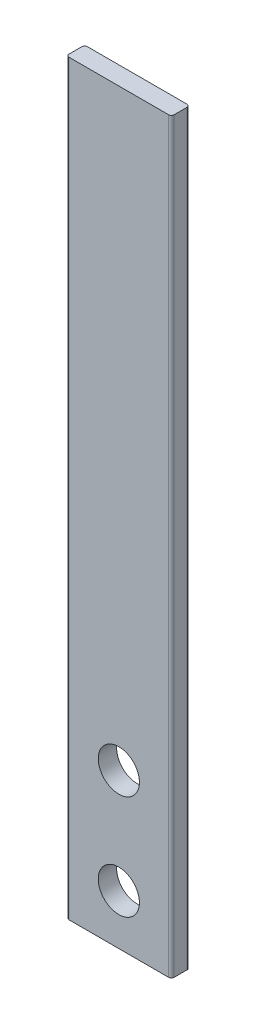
ISO-10303-21;
HEADER;
FILE_DESCRIPTION(('STEP AP214'),'2;1');
FILE_NAME('part.step','',(''),(''),'','','');
FILE_SCHEMA(('AUTOMOTIVE_DESIGN { 1 0 10303 214 1 1 1 1 }'));
ENDSEC;
DATA;
#1=APPLICATION_CONTEXT('core data for automotive mechanical design processes');
#2=APPLICATION_PROTOCOL_DEFINITION('international standard','automotive_design',2000,#1);
#3=PRODUCT_CONTEXT('',#1,'mechanical');
#4=PRODUCT('Part','Part','',(#3));
#5=PRODUCT_RELATED_PRODUCT_CATEGORY('part','',(#4));
#6=PRODUCT_DEFINITION_FORMATION('','',#4);
#7=PRODUCT_DEFINITION_CONTEXT('part definition',#1,'design');
#8=PRODUCT_DEFINITION('design','',#6,#7);
#9=PRODUCT_DEFINITION_SHAPE('','',#8);
#10=(LENGTH_UNIT() NAMED_UNIT(*) SI_UNIT(.MILLI.,.METRE.));
#11=(NAMED_UNIT(*) PLANE_ANGLE_UNIT() SI_UNIT($,.RADIAN.));
#12=(NAMED_UNIT(*) SI_UNIT($,.STERADIAN.) SOLID_ANGLE_UNIT());
#13=UNCERTAINTY_MEASURE_WITH_UNIT(LENGTH_MEASURE(1.E-05),#10,'distance_accuracy_value','');
#14=(GEOMETRIC_REPRESENTATION_CONTEXT(3) GLOBAL_UNCERTAINTY_ASSIGNED_CONTEXT((#13)) GLOBAL_UNIT_ASSIGNED_CONTEXT((#10,
#11,#12)) REPRESENTATION_CONTEXT('',''));
#15=CARTESIAN_POINT('',(0.,0.,0.));
#16=DIRECTION('',(0.,0.,1.));
#17=DIRECTION('',(1.,0.,0.));
#18=AXIS2_PLACEMENT_3D('',#15,#16,#17);
#19=CARTESIAN_POINT('',(4.8006,-34.1249,-1.6764));
#20=DIRECTION('',(1.,0.,0.));
#21=DIRECTION('',(0.,0.,-1.));
#22=AXIS2_PLACEMENT_3D('',#19,#20,#21);
#23=PLANE('',#22);
#24=DIRECTION('',(0.,0.,1.));
#25=VECTOR('',#24,1.);
#26=CARTESIAN_POINT('',(4.8006,-34.1249,-1.6764));
#27=LINE('',#26,#25);
#28=CARTESIAN_POINT('',(4.8006,-34.1249,-1.4224));
#29=VERTEX_POINT('',#28);
#30=CARTESIAN_POINT('',(4.8006,-34.1249,-0.254));
#31=VERTEX_POINT('',#30);
#32=EDGE_CURVE('E131',#29,#31,#27,.T.);
#33=ORIENTED_EDGE('',*,*,#32,.F.);
#34=DIRECTION('',(0.,1.,0.));
#35=VECTOR('',#34,1.);
#36=CARTESIAN_POINT('',(4.8006,-34.1249,-1.4224));
#37=LINE('',#36,#35);
#38=CARTESIAN_POINT('',(4.8006,34.1249,-1.4224));
#39=VERTEX_POINT('',#38);
#40=EDGE_CURVE('E148',#29,#39,#37,.T.);
#41=ORIENTED_EDGE('',*,*,#40,.T.);
#42=DIRECTION('',(0.,0.,1.));
#43=VECTOR('',#42,1.);
#44=CARTESIAN_POINT('',(4.8006,34.1249,-1.6764));
#45=LINE('',#44,#43);
#46=CARTESIAN_POINT('',(4.8006,34.1249,-0.254));
#47=VERTEX_POINT('',#46);
#48=EDGE_CURVE('E123',#39,#47,#45,.T.);
#49=ORIENTED_EDGE('',*,*,#48,.T.);
#50=DIRECTION('',(0.,1.,0.));
#51=VECTOR('',#50,1.);
#52=CARTESIAN_POINT('',(4.8006,-34.1249,-0.254));
#53=LINE('',#52,#51);
#54=EDGE_CURVE('E112',#47,#31,#53,.F.);
#55=ORIENTED_EDGE('',*,*,#54,.T.);
#56=EDGE_LOOP('',(#33,#41,#49,#55));
#57=FACE_BOUND('',#56,.T.);
#58=ADVANCED_FACE('F35',(#57),#23,.T.);
#59=CARTESIAN_POINT('',(-4.8006,-34.1249,-1.6764));
#60=DIRECTION('',(0.,-1.,0.));
#61=DIRECTION('',(0.,0.,-1.));
#62=AXIS2_PLACEMENT_3D('',#59,#60,#61);
#63=PLANE('',#62);
#64=DIRECTION('',(0.,0.,1.));
#65=VECTOR('',#64,1.);
#66=CARTESIAN_POINT('',(-4.8006,-34.1249,-1.6764));
#67=LINE('',#66,#65);
#68=CARTESIAN_POINT('',(-4.8006,-34.1249,-1.4224));
#69=VERTEX_POINT('',#68);
#70=CARTESIAN_POINT('',(-4.8006,-34.1249,-0.254));
#71=VERTEX_POINT('',#70);
#72=EDGE_CURVE('E122',#69,#71,#67,.T.);
#73=ORIENTED_EDGE('',*,*,#72,.F.);
#74=CARTESIAN_POINT('',(-4.5466,-34.1249,-1.4224));
#75=DIRECTION('',(0.,-1.,0.));
#76=DIRECTION('',(0.,0.,-1.));
#77=AXIS2_PLACEMENT_3D('',#74,#75,#76);
#78=CIRCLE('',#77,0.254);
#79=CARTESIAN_POINT('',(-4.5466,-34.1249,-1.6764));
#80=VERTEX_POINT('',#79);
#81=EDGE_CURVE('E126',#69,#80,#78,.T.);
#82=ORIENTED_EDGE('',*,*,#81,.T.);
#83=DIRECTION('',(1.,0.,0.));
#84=VECTOR('',#83,1.);
#85=CARTESIAN_POINT('',(-4.8006,-34.1249,-1.6764));
#86=LINE('',#85,#84);
#87=CARTESIAN_POINT('',(4.5466,-34.1249,-1.6764));
#88=VERTEX_POINT('',#87);
#89=EDGE_CURVE('E165',#80,#88,#86,.T.);
#90=ORIENTED_EDGE('',*,*,#89,.T.);
#91=CARTESIAN_POINT('',(4.5466,-34.1249,-1.4224));
#92=DIRECTION('',(0.,-1.,0.));
#93=DIRECTION('',(0.,0.,-1.));
#94=AXIS2_PLACEMENT_3D('',#91,#92,#93);
#95=CIRCLE('',#94,0.254);
#96=EDGE_CURVE('E136',#88,#29,#95,.T.);
#97=ORIENTED_EDGE('',*,*,#96,.T.);
#98=ORIENTED_EDGE('',*,*,#32,.T.);
#99=CARTESIAN_POINT('',(4.5466,-34.1249,-0.254));
#100=DIRECTION('',(0.,-1.,0.));
#101=DIRECTION('',(0.,0.,-1.));
#102=AXIS2_PLACEMENT_3D('',#99,#100,#101);
#103=CIRCLE('',#102,0.254);
#104=CARTESIAN_POINT('',(4.5466,-34.1249,0.));
#105=VERTEX_POINT('',#104);
#106=EDGE_CURVE('E129',#31,#105,#103,.T.);
#107=ORIENTED_EDGE('',*,*,#106,.T.);
#108=DIRECTION('',(1.,0.,0.));
#109=VECTOR('',#108,1.);
#110=CARTESIAN_POINT('',(-4.8006,-34.1249,0.));
#111=LINE('',#110,#109);
#112=CARTESIAN_POINT('',(-4.5466,-34.1249,0.));
#113=VERTEX_POINT('',#112);
#114=EDGE_CURVE('E156',#113,#105,#111,.T.);
#115=ORIENTED_EDGE('',*,*,#114,.F.);
#116=CARTESIAN_POINT('',(-4.5466,-34.1249,-0.254));
#117=DIRECTION('',(0.,-1.,0.));
#118=DIRECTION('',(0.,0.,-1.));
#119=AXIS2_PLACEMENT_3D('',#116,#117,#118);
#120=CIRCLE('',#119,0.254);
#121=EDGE_CURVE('E127',#113,#71,#120,.T.);
#122=ORIENTED_EDGE('',*,*,#121,.T.);
#123=EDGE_LOOP('',(#73,#82,#90,#97,#98,#107,#115,#122));
#124=FACE_BOUND('',#123,.T.);
#125=ADVANCED_FACE('F161',(#124),#63,.T.);
#126=CARTESIAN_POINT('',(-4.8006,-34.1249,-1.6764));
#127=DIRECTION('',(-1.,0.,0.));
#128=DIRECTION('',(0.,0.,1.));
#129=AXIS2_PLACEMENT_3D('',#126,#127,#128);
#130=PLANE('',#129);
#131=DIRECTION('',(0.,0.,1.));
#132=VECTOR('',#131,1.);
#133=CARTESIAN_POINT('',(-4.8006,34.1249,-1.6764));
#134=LINE('',#133,#132);
#135=CARTESIAN_POINT('',(-4.8006,34.1249,-1.4224));
#136=VERTEX_POINT('',#135);
#137=CARTESIAN_POINT('',(-4.8006,34.1249,-0.254));
#138=VERTEX_POINT('',#137);
#139=EDGE_CURVE('E105',#136,#138,#134,.T.);
#140=ORIENTED_EDGE('',*,*,#139,.F.);
#141=DIRECTION('',(0.,-1.,0.));
#142=VECTOR('',#141,1.);
#143=CARTESIAN_POINT('',(-4.8006,-34.1249,-1.4224));
#144=LINE('',#143,#142);
#145=EDGE_CURVE('E118',#136,#69,#144,.T.);
#146=ORIENTED_EDGE('',*,*,#145,.T.);
#147=ORIENTED_EDGE('',*,*,#72,.T.);
#148=DIRECTION('',(0.,-1.,0.));
#149=VECTOR('',#148,1.);
#150=CARTESIAN_POINT('',(-4.8006,34.1249,-0.254));
#151=LINE('',#150,#149);
#152=EDGE_CURVE('E121',#71,#138,#151,.F.);
#153=ORIENTED_EDGE('',*,*,#152,.T.);
#154=EDGE_LOOP('',(#140,#146,#147,#153));
#155=FACE_BOUND('',#154,.T.);
#156=ADVANCED_FACE('F116',(#155),#130,.T.);
#157=CARTESIAN_POINT('',(-4.8006,34.1249,-1.6764));
#158=DIRECTION('',(0.,1.,0.));
#159=DIRECTION('',(0.,0.,1.));
#160=AXIS2_PLACEMENT_3D('',#157,#158,#159);
#161=PLANE('',#160);
#162=DIRECTION('',(-1.,0.,0.));
#163=VECTOR('',#162,1.);
#164=CARTESIAN_POINT('',(-4.8006,34.1249,-1.6764));
#165=LINE('',#164,#163);
#166=CARTESIAN_POINT('',(4.5466,34.1249,-1.6764));
#167=VERTEX_POINT('',#166);
#168=CARTESIAN_POINT('',(-4.5466,34.1249,-1.6764));
#169=VERTEX_POINT('',#168);
#170=EDGE_CURVE('E108',#167,#169,#165,.T.);
#171=ORIENTED_EDGE('',*,*,#170,.T.);
#172=CARTESIAN_POINT('',(-4.5466,34.1249,-1.4224));
#173=DIRECTION('',(0.,1.,0.));
#174=DIRECTION('',(0.,0.,1.));
#175=AXIS2_PLACEMENT_3D('',#172,#173,#174);
#176=CIRCLE('',#175,0.254);
#177=EDGE_CURVE('E102',#169,#136,#176,.T.);
#178=ORIENTED_EDGE('',*,*,#177,.T.);
#179=ORIENTED_EDGE('',*,*,#139,.T.);
#180=CARTESIAN_POINT('',(-4.5466,34.1249,-0.254));
#181=DIRECTION('',(0.,1.,0.));
#182=DIRECTION('',(0.,0.,1.));
#183=AXIS2_PLACEMENT_3D('',#180,#181,#182);
#184=CIRCLE('',#183,0.254);
#185=CARTESIAN_POINT('',(-4.5466,34.1249,0.));
#186=VERTEX_POINT('',#185);
#187=EDGE_CURVE('E143',#138,#186,#184,.T.);
#188=ORIENTED_EDGE('',*,*,#187,.T.);
#189=DIRECTION('',(-1.,0.,0.));
#190=VECTOR('',#189,1.);
#191=CARTESIAN_POINT('',(-4.8006,34.1249,0.));
#192=LINE('',#191,#190);
#193=CARTESIAN_POINT('',(4.5466,34.1249,0.));
#194=VERTEX_POINT('',#193);
#195=EDGE_CURVE('E158',#194,#186,#192,.T.);
#196=ORIENTED_EDGE('',*,*,#195,.F.);
#197=CARTESIAN_POINT('',(4.5466,34.1249,-0.254));
#198=DIRECTION('',(0.,1.,0.));
#199=DIRECTION('',(0.,0.,1.));
#200=AXIS2_PLACEMENT_3D('',#197,#198,#199);
#201=CIRCLE('',#200,0.254);
#202=EDGE_CURVE('E50',#194,#47,#201,.T.);
#203=ORIENTED_EDGE('',*,*,#202,.T.);
#204=ORIENTED_EDGE('',*,*,#48,.F.);
#205=CARTESIAN_POINT('',(4.5466,34.1249,-1.4224));
#206=DIRECTION('',(0.,1.,0.));
#207=DIRECTION('',(0.,0.,1.));
#208=AXIS2_PLACEMENT_3D('',#205,#206,#207);
#209=CIRCLE('',#208,0.254);
#210=EDGE_CURVE('E58',#39,#167,#209,.T.);
#211=ORIENTED_EDGE('',*,*,#210,.T.);
#212=EDGE_LOOP('',(#171,#178,#179,#188,#196,#203,#204,#211));
#213=FACE_BOUND('',#212,.T.);
#214=ADVANCED_FACE('F104',(#213),#161,.T.);
#215=CARTESIAN_POINT('',(0.,0.,-1.6764));
#216=DIRECTION('',(0.,0.,-1.));
#217=DIRECTION('',(-1.,0.,0.));
#218=AXIS2_PLACEMENT_3D('',#215,#216,#217);
#219=PLANE('',#218);
#220=CARTESIAN_POINT('',(0.,-20.0279,-1.6764));
#221=DIRECTION('',(0.,0.,1.));
#222=DIRECTION('',(1.,0.,0.));
#223=AXIS2_PLACEMENT_3D('',#220,#221,#222);
#224=CIRCLE('',#223,1.8796);
#225=CARTESIAN_POINT('',(1.8796,-20.0279,-1.6764));
#226=VERTEX_POINT('',#225);
#227=EDGE_CURVE('E181',#226,#226,#224,.T.);
#228=ORIENTED_EDGE('',*,*,#227,.T.);
#229=EDGE_LOOP('',(#228));
#230=FACE_BOUND('',#229,.T.);
#231=CARTESIAN_POINT('',(0.,-29.5529,-1.6764));
#232=DIRECTION('',(0.,0.,1.));
#233=DIRECTION('',(1.,0.,0.));
#234=AXIS2_PLACEMENT_3D('',#231,#232,#233);
#235=CIRCLE('',#234,1.8796);
#236=CARTESIAN_POINT('',(1.8796,-29.5529,-1.6764));
#237=VERTEX_POINT('',#236);
#238=EDGE_CURVE('E167',#237,#237,#235,.T.);
#239=ORIENTED_EDGE('',*,*,#238,.T.);
#240=EDGE_LOOP('',(#239));
#241=FACE_BOUND('',#240,.T.);
#242=ORIENTED_EDGE('',*,*,#89,.F.);
#243=DIRECTION('',(0.,-1.,0.));
#244=VECTOR('',#243,1.);
#245=CARTESIAN_POINT('',(-4.5466,0.,-1.6764));
#246=LINE('',#245,#244);
#247=EDGE_CURVE('E141',#80,#169,#246,.F.);
#248=ORIENTED_EDGE('',*,*,#247,.T.);
#249=ORIENTED_EDGE('',*,*,#170,.F.);
#250=DIRECTION('',(0.,1.,0.));
#251=VECTOR('',#250,1.);
#252=CARTESIAN_POINT('',(4.5466,0.,-1.6764));
#253=LINE('',#252,#251);
#254=EDGE_CURVE('E139',#167,#88,#253,.F.);
#255=ORIENTED_EDGE('',*,*,#254,.T.);
#256=EDGE_LOOP('',(#242,#248,#249,#255));
#257=FACE_BOUND('',#256,.T.);
#258=ADVANCED_FACE('F190',(#230,#241,#257),#219,.T.);
#259=CARTESIAN_POINT('',(0.,0.,0.));
#260=DIRECTION('',(0.,0.,-1.));
#261=DIRECTION('',(-1.,0.,0.));
#262=AXIS2_PLACEMENT_3D('',#259,#260,#261);
#263=PLANE('',#262);
#264=CARTESIAN_POINT('',(0.,-20.0279,0.));
#265=DIRECTION('',(0.,0.,1.));
#266=DIRECTION('',(1.,0.,0.));
#267=AXIS2_PLACEMENT_3D('',#264,#265,#266);
#268=CIRCLE('',#267,1.8796);
#269=CARTESIAN_POINT('',(1.8796,-20.0279,0.));
#270=VERTEX_POINT('',#269);
#271=EDGE_CURVE('E184',#270,#270,#268,.T.);
#272=ORIENTED_EDGE('',*,*,#271,.F.);
#273=EDGE_LOOP('',(#272));
#274=FACE_BOUND('',#273,.T.);
#275=CARTESIAN_POINT('',(0.,-29.5529,0.));
#276=DIRECTION('',(0.,0.,1.));
#277=DIRECTION('',(1.,0.,0.));
#278=AXIS2_PLACEMENT_3D('',#275,#276,#277);
#279=CIRCLE('',#278,1.8796);
#280=CARTESIAN_POINT('',(1.8796,-29.5529,0.));
#281=VERTEX_POINT('',#280);
#282=EDGE_CURVE('E178',#281,#281,#279,.T.);
#283=ORIENTED_EDGE('',*,*,#282,.F.);
#284=EDGE_LOOP('',(#283));
#285=FACE_BOUND('',#284,.T.);
#286=ORIENTED_EDGE('',*,*,#114,.T.);
#287=DIRECTION('',(0.,1.,0.));
#288=VECTOR('',#287,1.);
#289=CARTESIAN_POINT('',(4.5466,34.1249,0.));
#290=LINE('',#289,#288);
#291=EDGE_CURVE('E11',#105,#194,#290,.T.);
#292=ORIENTED_EDGE('',*,*,#291,.T.);
#293=ORIENTED_EDGE('',*,*,#195,.T.);
#294=DIRECTION('',(0.,-1.,0.));
#295=VECTOR('',#294,1.);
#296=CARTESIAN_POINT('',(-4.5466,-34.1249,0.));
#297=LINE('',#296,#295);
#298=EDGE_CURVE('E43',#186,#113,#297,.T.);
#299=ORIENTED_EDGE('',*,*,#298,.T.);
#300=EDGE_LOOP('',(#286,#292,#293,#299));
#301=FACE_BOUND('',#300,.T.);
#302=ADVANCED_FACE('F155',(#274,#285,#301),#263,.F.);
#303=CARTESIAN_POINT('',(0.,-29.5529,-1.6764));
#304=DIRECTION('',(0.,0.,1.));
#305=DIRECTION('',(1.,0.,0.));
#306=AXIS2_PLACEMENT_3D('',#303,#304,#305);
#307=CYLINDRICAL_SURFACE('',#306,1.8796);
#308=ORIENTED_EDGE('',*,*,#238,.F.);
#309=EDGE_LOOP('',(#308));
#310=FACE_BOUND('',#309,.T.);
#311=ORIENTED_EDGE('',*,*,#282,.T.);
#312=EDGE_LOOP('',(#311));
#313=FACE_BOUND('',#312,.T.);
#314=ADVANCED_FACE('F196',(#310,#313),#307,.F.);
#315=CARTESIAN_POINT('',(0.,-20.0279,-1.6764));
#316=DIRECTION('',(0.,0.,1.));
#317=DIRECTION('',(1.,0.,0.));
#318=AXIS2_PLACEMENT_3D('',#315,#316,#317);
#319=CYLINDRICAL_SURFACE('',#318,1.8796);
#320=ORIENTED_EDGE('',*,*,#227,.F.);
#321=EDGE_LOOP('',(#320));
#322=FACE_BOUND('',#321,.T.);
#323=ORIENTED_EDGE('',*,*,#271,.T.);
#324=EDGE_LOOP('',(#323));
#325=FACE_BOUND('',#324,.T.);
#326=ADVANCED_FACE('F193',(#322,#325),#319,.F.);
#327=CARTESIAN_POINT('',(-4.5466,-34.1249,-1.4224));
#328=DIRECTION('',(0.,-1.,0.));
#329=DIRECTION('',(0.,0.,-1.));
#330=AXIS2_PLACEMENT_3D('',#327,#328,#329);
#331=CYLINDRICAL_SURFACE('',#330,0.254);
#332=ORIENTED_EDGE('',*,*,#177,.F.);
#333=ORIENTED_EDGE('',*,*,#247,.F.);
#334=ORIENTED_EDGE('',*,*,#81,.F.);
#335=ORIENTED_EDGE('',*,*,#145,.F.);
#336=EDGE_LOOP('',(#332,#333,#334,#335));
#337=FACE_BOUND('',#336,.T.);
#338=ADVANCED_FACE('F125',(#337),#331,.T.);
#339=CARTESIAN_POINT('',(4.5466,-34.1249,-1.4224));
#340=DIRECTION('',(0.,1.,0.));
#341=DIRECTION('',(0.,0.,1.));
#342=AXIS2_PLACEMENT_3D('',#339,#340,#341);
#343=CYLINDRICAL_SURFACE('',#342,0.254);
#344=ORIENTED_EDGE('',*,*,#96,.F.);
#345=ORIENTED_EDGE('',*,*,#254,.F.);
#346=ORIENTED_EDGE('',*,*,#210,.F.);
#347=ORIENTED_EDGE('',*,*,#40,.F.);
#348=EDGE_LOOP('',(#344,#345,#346,#347));
#349=FACE_BOUND('',#348,.T.);
#350=ADVANCED_FACE('F224',(#349),#343,.T.);
#351=CARTESIAN_POINT('',(4.5466,0.,-0.254));
#352=DIRECTION('',(0.,-1.,0.));
#353=DIRECTION('',(0.,0.,-1.));
#354=AXIS2_PLACEMENT_3D('',#351,#352,#353);
#355=CYLINDRICAL_SURFACE('',#354,0.254);
#356=ORIENTED_EDGE('',*,*,#106,.F.);
#357=ORIENTED_EDGE('',*,*,#54,.F.);
#358=ORIENTED_EDGE('',*,*,#202,.F.);
#359=ORIENTED_EDGE('',*,*,#291,.F.);
#360=EDGE_LOOP('',(#356,#357,#358,#359));
#361=FACE_BOUND('',#360,.T.);
#362=ADVANCED_FACE('F226',(#361),#355,.T.);
#363=CARTESIAN_POINT('',(-4.5466,0.,-0.254));
#364=DIRECTION('',(0.,1.,0.));
#365=DIRECTION('',(0.,0.,1.));
#366=AXIS2_PLACEMENT_3D('',#363,#364,#365);
#367=CYLINDRICAL_SURFACE('',#366,0.254);
#368=ORIENTED_EDGE('',*,*,#187,.F.);
#369=ORIENTED_EDGE('',*,*,#152,.F.);
#370=ORIENTED_EDGE('',*,*,#121,.F.);
#371=ORIENTED_EDGE('',*,*,#298,.F.);
#372=EDGE_LOOP('',(#368,#369,#370,#371));
#373=FACE_BOUND('',#372,.T.);
#374=ADVANCED_FACE('F37',(#373),#367,.T.);
#375=CLOSED_SHELL('',(#58,#125,#156,#214,#258,#302,#314,#326,#338,#350,#362,#374));
#376=MANIFOLD_SOLID_BREP('B2',#375);
#377=ADVANCED_BREP_SHAPE_REPRESENTATION('',(#18,#376),#14);
#378=SHAPE_DEFINITION_REPRESENTATION(#9,#377);
ENDSEC;
END-ISO-10303-21;
